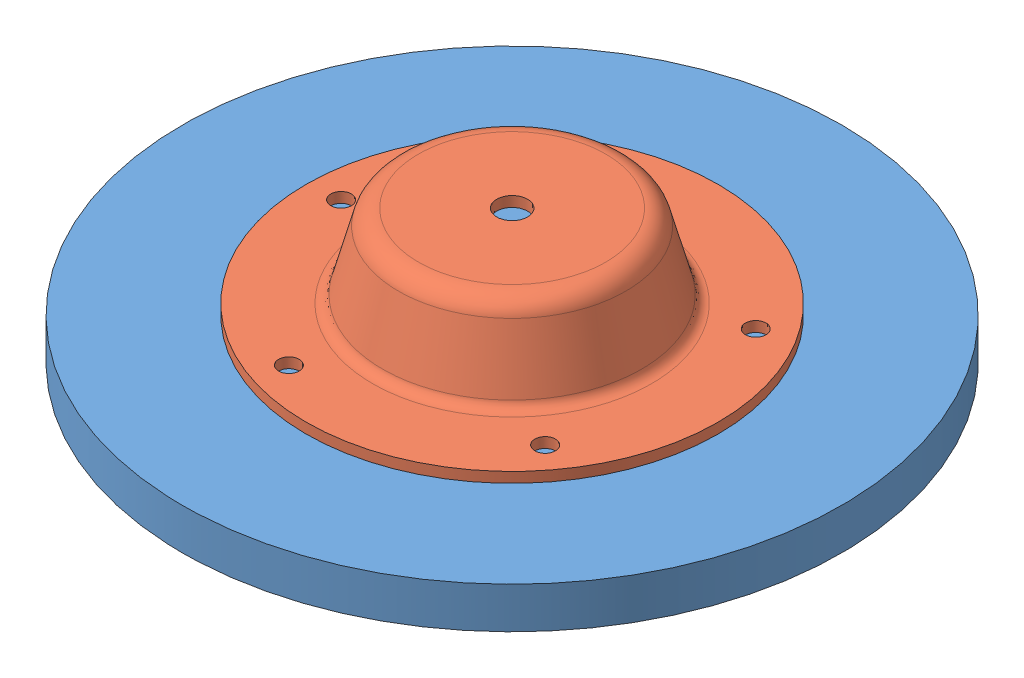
SolidWorks assembly Table Assy - Feature Driven.SLDASM, configuration Default (file format 3100). Lengths in mm.
Overall size (203.2 41.27 203.2).
2 component instances, 2 part files, 2 mates.
Components (placement in the parent):
- Table Top-1: Table Top.SLDPRT [Default] at origin size (203.2 12.7 203.2)
- Flange-1: Flange.SLDPRT [Default] at (0 12.7 0) x (0.79516 0 0.6064) z (-0.6064 0 0.79516) size (127 28.57 127)
Mates (geometry in assembly coordinates):
- Coincident1: coincident anti-aligned: plane of Table Top-1 through (0 12.7 0) normal (0 1 0); plane of Flange-1 through (-50.4927 12.7 -38.5064) normal (0 -1 0)
- Concentric1: concentric aligned: cylinder of Table Top-1; cylinder of Flange-1
